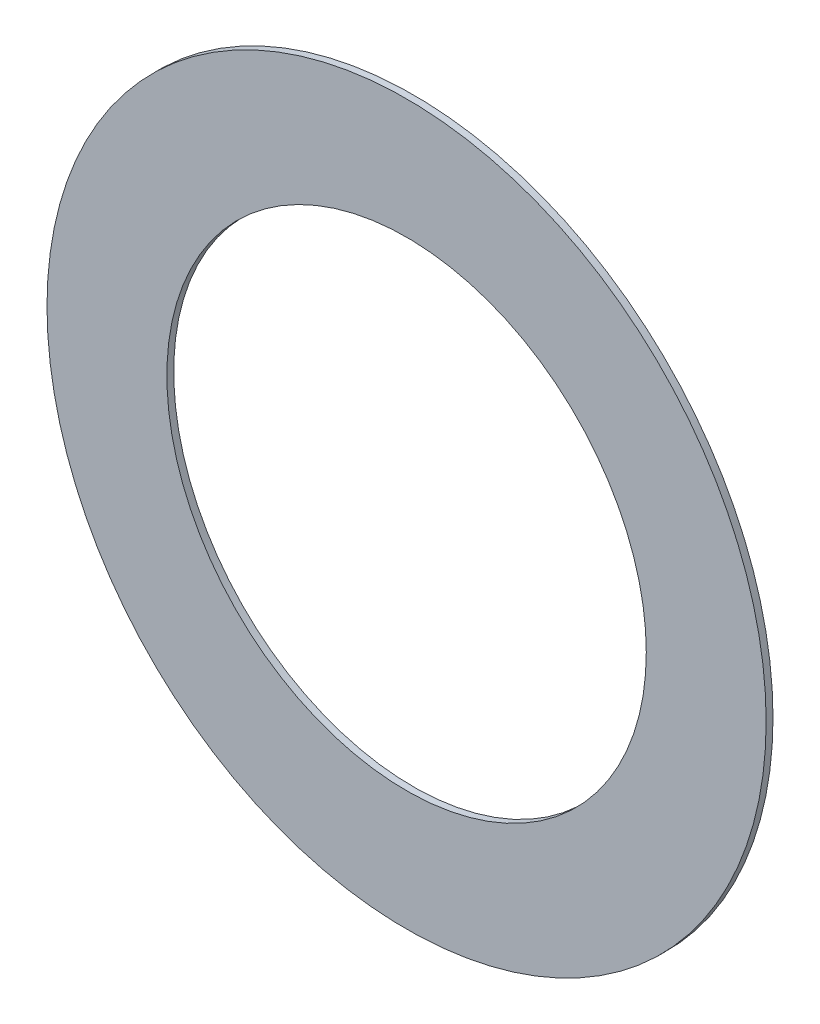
from build123d import *

# Parameters (mm, degrees)
ESQUISSE1_R          = 10.5
ESQUISSE1_R_2        = 7
BASE_EXTRUSION_DEPTH = 0.2


with BuildPart() as part:
    # Esquisse1 → Base-Extrusion (new body)
    with BuildSketch(Plane(origin=(0, 0, -0.2), x_dir=(-1, 0, 0), z_dir=(0, 0, -1))):
        with Locations(Location((0, 0, 0), (0, 0, 180))):
            Circle(ESQUISSE1_R)
        with Locations(Location((0, 0, 0), (0, 0, 180))):
            Circle(ESQUISSE1_R_2, mode=Mode.SUBTRACT)
    extrude(amount=-BASE_EXTRUSION_DEPTH)


solid = part.part
